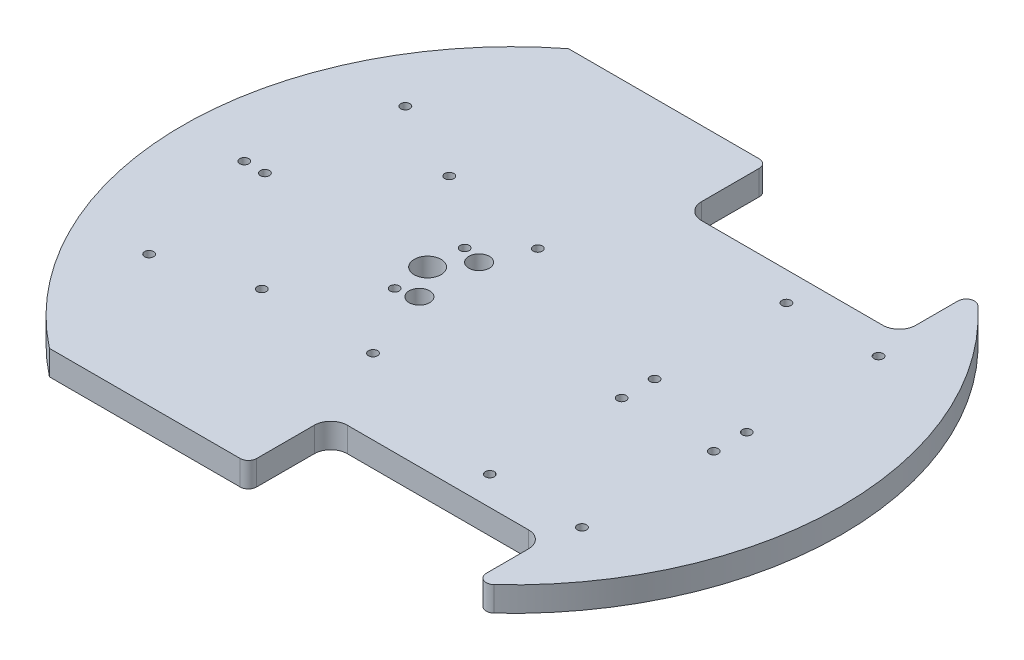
ISO-10303-21;
HEADER;
FILE_DESCRIPTION(('STEP AP214'),'2;1');
FILE_NAME('part.step','',(''),(''),'','','');
FILE_SCHEMA(('AUTOMOTIVE_DESIGN { 1 0 10303 214 1 1 1 1 }'));
ENDSEC;
DATA;
#1=APPLICATION_CONTEXT('core data for automotive mechanical design processes');
#2=APPLICATION_PROTOCOL_DEFINITION('international standard','automotive_design',2000,#1);
#3=PRODUCT_CONTEXT('',#1,'mechanical');
#4=PRODUCT('Part','Part','',(#3));
#5=PRODUCT_RELATED_PRODUCT_CATEGORY('part','',(#4));
#6=PRODUCT_DEFINITION_FORMATION('','',#4);
#7=PRODUCT_DEFINITION_CONTEXT('part definition',#1,'design');
#8=PRODUCT_DEFINITION('design','',#6,#7);
#9=PRODUCT_DEFINITION_SHAPE('','',#8);
#10=(LENGTH_UNIT() NAMED_UNIT(*) SI_UNIT(.MILLI.,.METRE.));
#11=(NAMED_UNIT(*) PLANE_ANGLE_UNIT() SI_UNIT($,.RADIAN.));
#12=(NAMED_UNIT(*) SI_UNIT($,.STERADIAN.) SOLID_ANGLE_UNIT());
#13=UNCERTAINTY_MEASURE_WITH_UNIT(LENGTH_MEASURE(1.E-05),#10,'distance_accuracy_value','');
#14=(GEOMETRIC_REPRESENTATION_CONTEXT(3) GLOBAL_UNCERTAINTY_ASSIGNED_CONTEXT((#13)) GLOBAL_UNIT_ASSIGNED_CONTEXT((#10,
#11,#12)) REPRESENTATION_CONTEXT('',''));
#15=CARTESIAN_POINT('',(0.,0.,0.));
#16=DIRECTION('',(0.,0.,1.));
#17=DIRECTION('',(1.,0.,0.));
#18=AXIS2_PLACEMENT_3D('',#15,#16,#17);
#19=CARTESIAN_POINT('',(-15.,6.,0.));
#20=DIRECTION('',(0.,1.,0.));
#21=DIRECTION('',(0.,0.,1.));
#22=AXIS2_PLACEMENT_3D('',#19,#20,#21);
#23=PLANE('',#22);
#24=CARTESIAN_POINT('',(-52.,6.,-21.75));
#25=DIRECTION('',(0.,1.,0.));
#26=DIRECTION('',(0.,0.,1.));
#27=AXIS2_PLACEMENT_3D('',#24,#25,#26);
#28=CIRCLE('',#27,1.1);
#29=CARTESIAN_POINT('',(-52.,6.,-20.65));
#30=VERTEX_POINT('',#29);
#31=EDGE_CURVE('E483',#30,#30,#28,.T.);
#32=ORIENTED_EDGE('',*,*,#31,.F.);
#33=EDGE_LOOP('',(#32));
#34=FACE_BOUND('',#33,.T.);
#35=CARTESIAN_POINT('',(-24.,6.,24.75));
#36=DIRECTION('',(0.,1.,0.));
#37=DIRECTION('',(0.,0.,-1.));
#38=AXIS2_PLACEMENT_3D('',#35,#36,#37);
#39=CIRCLE('',#38,1.1);
#40=CARTESIAN_POINT('',(-24.,6.,23.65));
#41=VERTEX_POINT('',#40);
#42=EDGE_CURVE('E495',#41,#41,#39,.T.);
#43=ORIENTED_EDGE('',*,*,#42,.F.);
#44=EDGE_LOOP('',(#43));
#45=FACE_BOUND('',#44,.T.);
#46=CARTESIAN_POINT('',(-30.25,6.,7.25));
#47=DIRECTION('',(0.,1.,0.));
#48=DIRECTION('',(0.,0.,1.));
#49=AXIS2_PLACEMENT_3D('',#46,#47,#48);
#50=CIRCLE('',#49,2.5);
#51=CARTESIAN_POINT('',(-30.25,6.,9.75));
#52=VERTEX_POINT('',#51);
#53=EDGE_CURVE('E507',#52,#52,#50,.T.);
#54=ORIENTED_EDGE('',*,*,#53,.F.);
#55=EDGE_LOOP('',(#54));
#56=FACE_BOUND('',#55,.T.);
#57=CARTESIAN_POINT('',(-35.,6.,-8.5));
#58=DIRECTION('',(0.,1.,0.));
#59=DIRECTION('',(0.,0.,1.));
#60=AXIS2_PLACEMENT_3D('',#57,#58,#59);
#61=CIRCLE('',#60,1.1);
#62=CARTESIAN_POINT('',(-35.,6.,-7.4));
#63=VERTEX_POINT('',#62);
#64=EDGE_CURVE('E519',#63,#63,#61,.T.);
#65=ORIENTED_EDGE('',*,*,#64,.F.);
#66=EDGE_LOOP('',(#65));
#67=FACE_BOUND('',#66,.T.);
#68=CARTESIAN_POINT('',(-80.,6.,0.));
#69=DIRECTION('',(0.,1.,0.));
#70=DIRECTION('',(0.,0.,1.));
#71=AXIS2_PLACEMENT_3D('',#68,#69,#70);
#72=CIRCLE('',#71,1.10000000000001);
#73=CARTESIAN_POINT('',(-80.,6.,1.10000000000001));
#74=VERTEX_POINT('',#73);
#75=EDGE_CURVE('E531',#74,#74,#72,.T.);
#76=ORIENTED_EDGE('',*,*,#75,.F.);
#77=EDGE_LOOP('',(#76));
#78=FACE_BOUND('',#77,.T.);
#79=CARTESIAN_POINT('',(-30.25,6.,-7.25));
#80=DIRECTION('',(0.,1.,0.));
#81=DIRECTION('',(0.,0.,-1.));
#82=AXIS2_PLACEMENT_3D('',#79,#80,#81);
#83=CIRCLE('',#82,2.5);
#84=CARTESIAN_POINT('',(-30.25,6.,-9.75));
#85=VERTEX_POINT('',#84);
#86=EDGE_CURVE('E543',#85,#85,#83,.T.);
#87=ORIENTED_EDGE('',*,*,#86,.F.);
#88=EDGE_LOOP('',(#87));
#89=FACE_BOUND('',#88,.T.);
#90=CARTESIAN_POINT('',(15.6,6.,-4.));
#91=DIRECTION('',(0.,1.,0.));
#92=DIRECTION('',(0.,0.,-1.));
#93=AXIS2_PLACEMENT_3D('',#90,#91,#92);
#94=CIRCLE('',#93,1.1);
#95=CARTESIAN_POINT('',(15.6,6.,-5.1));
#96=VERTEX_POINT('',#95);
#97=EDGE_CURVE('E555',#96,#96,#94,.T.);
#98=ORIENTED_EDGE('',*,*,#97,.F.);
#99=EDGE_LOOP('',(#98));
#100=FACE_BOUND('',#99,.T.);
#101=CARTESIAN_POINT('',(37.9590359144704,6.,-36.));
#102=DIRECTION('',(0.,1.,0.));
#103=DIRECTION('',(0.,0.,1.));
#104=AXIS2_PLACEMENT_3D('',#101,#102,#103);
#105=CIRCLE('',#104,1.1);
#106=CARTESIAN_POINT('',(37.9590359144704,6.,-34.9));
#107=VERTEX_POINT('',#106);
#108=EDGE_CURVE('E567',#107,#107,#105,.T.);
#109=ORIENTED_EDGE('',*,*,#108,.F.);
#110=EDGE_LOOP('',(#109));
#111=FACE_BOUND('',#110,.T.);
#112=CARTESIAN_POINT('',(37.9590359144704,6.,36.));
#113=DIRECTION('',(0.,1.,0.));
#114=DIRECTION('',(0.,0.,-1.));
#115=AXIS2_PLACEMENT_3D('',#112,#113,#114);
#116=CIRCLE('',#115,1.1);
#117=CARTESIAN_POINT('',(37.9590359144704,6.,34.9));
#118=VERTEX_POINT('',#117);
#119=EDGE_CURVE('E579',#118,#118,#116,.T.);
#120=ORIENTED_EDGE('',*,*,#119,.F.);
#121=EDGE_LOOP('',(#120));
#122=FACE_BOUND('',#121,.T.);
#123=CARTESIAN_POINT('',(15.6,6.,4.));
#124=DIRECTION('',(0.,1.,0.));
#125=DIRECTION('',(0.,0.,1.));
#126=AXIS2_PLACEMENT_3D('',#123,#124,#125);
#127=CIRCLE('',#126,1.1);
#128=CARTESIAN_POINT('',(15.6,6.,5.1));
#129=VERTEX_POINT('',#128);
#130=EDGE_CURVE('E591',#129,#129,#127,.T.);
#131=ORIENTED_EDGE('',*,*,#130,.F.);
#132=EDGE_LOOP('',(#131));
#133=FACE_BOUND('',#132,.T.);
#134=CARTESIAN_POINT('',(-15.,6.,0.));
#135=DIRECTION('',(0.,1.,0.));
#136=DIRECTION('',(0.,0.,1.));
#137=AXIS2_PLACEMENT_3D('',#134,#135,#136);
#138=CIRCLE('',#137,80.);
#139=CARTESIAN_POINT('',(-64.3051721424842,6.,-63.));
#140=VERTEX_POINT('',#139);
#141=CARTESIAN_POINT('',(-64.3051721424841,6.,63.));
#142=VERTEX_POINT('',#141);
#143=EDGE_CURVE('E215',#140,#142,#138,.T.);
#144=ORIENTED_EDGE('',*,*,#143,.T.);
#145=DIRECTION('',(1.,0.,0.));
#146=VECTOR('',#145,1.);
#147=CARTESIAN_POINT('',(-64.3051721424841,6.,63.));
#148=LINE('',#147,#146);
#149=CARTESIAN_POINT('',(-18.,6.,63.));
#150=VERTEX_POINT('',#149);
#151=EDGE_CURVE('E172',#142,#150,#148,.T.);
#152=ORIENTED_EDGE('',*,*,#151,.T.);
#153=CARTESIAN_POINT('',(-18.,6.,61.));
#154=DIRECTION('',(0.,1.,0.));
#155=DIRECTION('',(0.,0.,1.));
#156=AXIS2_PLACEMENT_3D('',#153,#154,#155);
#157=CIRCLE('',#156,2.);
#158=CARTESIAN_POINT('',(-16.,6.,61.));
#159=VERTEX_POINT('',#158);
#160=EDGE_CURVE('E218',#150,#159,#157,.T.);
#161=ORIENTED_EDGE('',*,*,#160,.T.);
#162=DIRECTION('',(0.,0.,-1.));
#163=VECTOR('',#162,1.);
#164=CARTESIAN_POINT('',(-16.,6.,61.));
#165=LINE('',#164,#163);
#166=CARTESIAN_POINT('',(-16.,6.,47.));
#167=VERTEX_POINT('',#166);
#168=EDGE_CURVE('E220',#159,#167,#165,.T.);
#169=ORIENTED_EDGE('',*,*,#168,.T.);
#170=CARTESIAN_POINT('',(-12.,6.,47.));
#171=DIRECTION('',(0.,-1.,0.));
#172=DIRECTION('',(0.,0.,-1.));
#173=AXIS2_PLACEMENT_3D('',#170,#171,#172);
#174=CIRCLE('',#173,4.);
#175=CARTESIAN_POINT('',(-12.,6.,43.));
#176=VERTEX_POINT('',#175);
#177=EDGE_CURVE('E222',#167,#176,#174,.T.);
#178=ORIENTED_EDGE('',*,*,#177,.T.);
#179=DIRECTION('',(1.,0.,0.));
#180=VECTOR('',#179,1.);
#181=CARTESIAN_POINT('',(-12.,6.,43.));
#182=LINE('',#181,#180);
#183=CARTESIAN_POINT('',(32.,6.,43.));
#184=VERTEX_POINT('',#183);
#185=EDGE_CURVE('E224',#176,#184,#182,.T.);
#186=ORIENTED_EDGE('',*,*,#185,.T.);
#187=CARTESIAN_POINT('',(32.,6.,47.));
#188=DIRECTION('',(0.,-1.,0.));
#189=DIRECTION('',(0.,0.,-1.));
#190=AXIS2_PLACEMENT_3D('',#187,#188,#189);
#191=CIRCLE('',#190,4.);
#192=CARTESIAN_POINT('',(36.,6.,47.));
#193=VERTEX_POINT('',#192);
#194=EDGE_CURVE('E226',#184,#193,#191,.T.);
#195=ORIENTED_EDGE('',*,*,#194,.T.);
#196=DIRECTION('',(0.,0.,1.));
#197=VECTOR('',#196,1.);
#198=CARTESIAN_POINT('',(36.,6.,57.227615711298));
#199=LINE('',#198,#197);
#200=CARTESIAN_POINT('',(36.,6.,57.227615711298));
#201=VERTEX_POINT('',#200);
#202=EDGE_CURVE('E228',#193,#201,#199,.T.);
#203=ORIENTED_EDGE('',*,*,#202,.T.);
#204=CARTESIAN_POINT('',(38.,6.,57.227615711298));
#205=DIRECTION('',(0.,1.,0.));
#206=DIRECTION('',(0.,0.,1.));
#207=AXIS2_PLACEMENT_3D('',#204,#205,#206);
#208=CIRCLE('',#207,2.);
#209=CARTESIAN_POINT('',(39.3589743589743,6.,58.6949904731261));
#210=VERTEX_POINT('',#209);
#211=EDGE_CURVE('E230',#201,#210,#208,.T.);
#212=ORIENTED_EDGE('',*,*,#211,.T.);
#213=CARTESIAN_POINT('',(-15.,6.,0.));
#214=DIRECTION('',(0.,1.,0.));
#215=DIRECTION('',(0.,0.,1.));
#216=AXIS2_PLACEMENT_3D('',#213,#214,#215);
#217=CIRCLE('',#216,80.);
#218=CARTESIAN_POINT('',(39.3589743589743,6.,-58.6949904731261));
#219=VERTEX_POINT('',#218);
#220=EDGE_CURVE('E232',#210,#219,#217,.T.);
#221=ORIENTED_EDGE('',*,*,#220,.T.);
#222=CARTESIAN_POINT('',(38.,6.,-57.227615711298));
#223=DIRECTION('',(0.,1.,0.));
#224=DIRECTION('',(0.,0.,1.));
#225=AXIS2_PLACEMENT_3D('',#222,#223,#224);
#226=CIRCLE('',#225,2.);
#227=CARTESIAN_POINT('',(36.,6.,-57.227615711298));
#228=VERTEX_POINT('',#227);
#229=EDGE_CURVE('E234',#219,#228,#226,.T.);
#230=ORIENTED_EDGE('',*,*,#229,.T.);
#231=DIRECTION('',(0.,0.,1.));
#232=VECTOR('',#231,1.);
#233=CARTESIAN_POINT('',(36.,6.,-57.227615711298));
#234=LINE('',#233,#232);
#235=CARTESIAN_POINT('',(36.,6.,-47.));
#236=VERTEX_POINT('',#235);
#237=EDGE_CURVE('E236',#228,#236,#234,.T.);
#238=ORIENTED_EDGE('',*,*,#237,.T.);
#239=CARTESIAN_POINT('',(32.,6.,-47.));
#240=DIRECTION('',(0.,-1.,0.));
#241=DIRECTION('',(0.,0.,-1.));
#242=AXIS2_PLACEMENT_3D('',#239,#240,#241);
#243=CIRCLE('',#242,4.);
#244=CARTESIAN_POINT('',(32.,6.,-43.));
#245=VERTEX_POINT('',#244);
#246=EDGE_CURVE('E238',#236,#245,#243,.T.);
#247=ORIENTED_EDGE('',*,*,#246,.T.);
#248=DIRECTION('',(-1.,0.,0.));
#249=VECTOR('',#248,1.);
#250=CARTESIAN_POINT('',(-12.,6.,-43.));
#251=LINE('',#250,#249);
#252=CARTESIAN_POINT('',(-12.,6.,-43.));
#253=VERTEX_POINT('',#252);
#254=EDGE_CURVE('E240',#245,#253,#251,.T.);
#255=ORIENTED_EDGE('',*,*,#254,.T.);
#256=CARTESIAN_POINT('',(-12.,6.,-47.));
#257=DIRECTION('',(0.,-1.,0.));
#258=DIRECTION('',(0.,0.,-1.));
#259=AXIS2_PLACEMENT_3D('',#256,#257,#258);
#260=CIRCLE('',#259,4.);
#261=CARTESIAN_POINT('',(-16.,6.,-47.));
#262=VERTEX_POINT('',#261);
#263=EDGE_CURVE('E242',#253,#262,#260,.T.);
#264=ORIENTED_EDGE('',*,*,#263,.T.);
#265=DIRECTION('',(0.,0.,-1.));
#266=VECTOR('',#265,1.);
#267=CARTESIAN_POINT('',(-16.,6.,-61.));
#268=LINE('',#267,#266);
#269=CARTESIAN_POINT('',(-16.,6.,-61.));
#270=VERTEX_POINT('',#269);
#271=EDGE_CURVE('E244',#262,#270,#268,.T.);
#272=ORIENTED_EDGE('',*,*,#271,.T.);
#273=CARTESIAN_POINT('',(-18.,6.,-61.));
#274=DIRECTION('',(0.,1.,0.));
#275=DIRECTION('',(0.,0.,1.));
#276=AXIS2_PLACEMENT_3D('',#273,#274,#275);
#277=CIRCLE('',#276,2.);
#278=CARTESIAN_POINT('',(-18.,6.,-63.));
#279=VERTEX_POINT('',#278);
#280=EDGE_CURVE('E53',#270,#279,#277,.T.);
#281=ORIENTED_EDGE('',*,*,#280,.T.);
#282=DIRECTION('',(-1.,0.,0.));
#283=VECTOR('',#282,1.);
#284=CARTESIAN_POINT('',(-64.3051721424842,6.,-63.));
#285=LINE('',#284,#283);
#286=EDGE_CURVE('E48',#279,#140,#285,.T.);
#287=ORIENTED_EDGE('',*,*,#286,.T.);
#288=EDGE_LOOP('',(#144,#152,#161,#169,#178,#186,#195,#203,#212,#221,#230,#238,#247,#255,#264,
#272,#281,#287));
#289=FACE_BOUND('',#288,.T.);
#290=CARTESIAN_POINT('',(37.9590359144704,6.,-4.));
#291=DIRECTION('',(0.,1.,0.));
#292=DIRECTION('',(0.,0.,-1.));
#293=AXIS2_PLACEMENT_3D('',#290,#291,#292);
#294=CIRCLE('',#293,1.1);
#295=CARTESIAN_POINT('',(37.9590359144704,6.,-5.1));
#296=VERTEX_POINT('',#295);
#297=EDGE_CURVE('E177',#296,#296,#294,.T.);
#298=ORIENTED_EDGE('',*,*,#297,.F.);
#299=EDGE_LOOP('',(#298));
#300=FACE_BOUND('',#299,.T.);
#301=CARTESIAN_POINT('',(37.9590359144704,6.,4.));
#302=DIRECTION('',(0.,1.,0.));
#303=DIRECTION('',(0.,0.,1.));
#304=AXIS2_PLACEMENT_3D('',#301,#302,#303);
#305=CIRCLE('',#304,1.1);
#306=CARTESIAN_POINT('',(37.9590359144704,6.,5.1));
#307=VERTEX_POINT('',#306);
#308=EDGE_CURVE('E585',#307,#307,#305,.T.);
#309=ORIENTED_EDGE('',*,*,#308,.F.);
#310=EDGE_LOOP('',(#309));
#311=FACE_BOUND('',#310,.T.);
#312=CARTESIAN_POINT('',(15.6,6.,36.));
#313=DIRECTION('',(0.,1.,0.));
#314=DIRECTION('',(0.,0.,-1.));
#315=AXIS2_PLACEMENT_3D('',#312,#313,#314);
#316=CIRCLE('',#315,1.09999999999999);
#317=CARTESIAN_POINT('',(15.6,6.,34.9));
#318=VERTEX_POINT('',#317);
#319=EDGE_CURVE('E573',#318,#318,#316,.T.);
#320=ORIENTED_EDGE('',*,*,#319,.F.);
#321=EDGE_LOOP('',(#320));
#322=FACE_BOUND('',#321,.T.);
#323=CARTESIAN_POINT('',(15.6,6.,-36.));
#324=DIRECTION('',(0.,1.,0.));
#325=DIRECTION('',(0.,0.,1.));
#326=AXIS2_PLACEMENT_3D('',#323,#324,#325);
#327=CIRCLE('',#326,1.09999999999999);
#328=CARTESIAN_POINT('',(15.6,6.,-34.9));
#329=VERTEX_POINT('',#328);
#330=EDGE_CURVE('E561',#329,#329,#327,.T.);
#331=ORIENTED_EDGE('',*,*,#330,.F.);
#332=EDGE_LOOP('',(#331));
#333=FACE_BOUND('',#332,.T.);
#334=CARTESIAN_POINT('',(-35.,6.,8.5));
#335=DIRECTION('',(0.,1.,0.));
#336=DIRECTION('',(0.,0.,-1.));
#337=AXIS2_PLACEMENT_3D('',#334,#335,#336);
#338=CIRCLE('',#337,1.1);
#339=CARTESIAN_POINT('',(-35.,6.,7.4));
#340=VERTEX_POINT('',#339);
#341=EDGE_CURVE('E549',#340,#340,#338,.T.);
#342=ORIENTED_EDGE('',*,*,#341,.F.);
#343=EDGE_LOOP('',(#342));
#344=FACE_BOUND('',#343,.T.);
#345=CARTESIAN_POINT('',(-72.,6.,31.1));
#346=DIRECTION('',(0.,1.,0.));
#347=DIRECTION('',(0.,0.,-1.));
#348=AXIS2_PLACEMENT_3D('',#345,#346,#347);
#349=CIRCLE('',#348,1.10000000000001);
#350=CARTESIAN_POINT('',(-72.,6.,30.));
#351=VERTEX_POINT('',#350);
#352=EDGE_CURVE('E537',#351,#351,#349,.T.);
#353=ORIENTED_EDGE('',*,*,#352,.F.);
#354=EDGE_LOOP('',(#353));
#355=FACE_BOUND('',#354,.T.);
#356=CARTESIAN_POINT('',(-72.,6.,-31.1));
#357=DIRECTION('',(0.,1.,0.));
#358=DIRECTION('',(0.,0.,1.));
#359=AXIS2_PLACEMENT_3D('',#356,#357,#358);
#360=CIRCLE('',#359,1.10000000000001);
#361=CARTESIAN_POINT('',(-72.,6.,-30.));
#362=VERTEX_POINT('',#361);
#363=EDGE_CURVE('E525',#362,#362,#360,.T.);
#364=ORIENTED_EDGE('',*,*,#363,.F.);
#365=EDGE_LOOP('',(#364));
#366=FACE_BOUND('',#365,.T.);
#367=CARTESIAN_POINT('',(-35.5,6.,0.));
#368=DIRECTION('',(0.,1.,0.));
#369=DIRECTION('',(0.,0.,1.));
#370=AXIS2_PLACEMENT_3D('',#367,#368,#369);
#371=CIRCLE('',#370,3.25);
#372=CARTESIAN_POINT('',(-35.5,6.,3.25));
#373=VERTEX_POINT('',#372);
#374=EDGE_CURVE('E513',#373,#373,#371,.T.);
#375=ORIENTED_EDGE('',*,*,#374,.F.);
#376=EDGE_LOOP('',(#375));
#377=FACE_BOUND('',#376,.T.);
#378=CARTESIAN_POINT('',(-51.,6.,24.75));
#379=DIRECTION('',(0.,1.,0.));
#380=DIRECTION('',(0.,0.,1.));
#381=AXIS2_PLACEMENT_3D('',#378,#379,#380);
#382=CIRCLE('',#381,1.1);
#383=CARTESIAN_POINT('',(-51.,6.,25.85));
#384=VERTEX_POINT('',#383);
#385=EDGE_CURVE('E501',#384,#384,#382,.T.);
#386=ORIENTED_EDGE('',*,*,#385,.F.);
#387=EDGE_LOOP('',(#386));
#388=FACE_BOUND('',#387,.T.);
#389=CARTESIAN_POINT('',(-26.,6.,-17.25));
#390=DIRECTION('',(0.,1.,0.));
#391=DIRECTION('',(0.,0.,1.));
#392=AXIS2_PLACEMENT_3D('',#389,#390,#391);
#393=CIRCLE('',#392,1.1);
#394=CARTESIAN_POINT('',(-26.,6.,-16.15));
#395=VERTEX_POINT('',#394);
#396=EDGE_CURVE('E489',#395,#395,#393,.T.);
#397=ORIENTED_EDGE('',*,*,#396,.F.);
#398=EDGE_LOOP('',(#397));
#399=FACE_BOUND('',#398,.T.);
#400=CARTESIAN_POINT('',(-75.,6.,0.));
#401=DIRECTION('',(0.,1.,0.));
#402=DIRECTION('',(0.,0.,1.));
#403=AXIS2_PLACEMENT_3D('',#400,#401,#402);
#404=CIRCLE('',#403,1.10000000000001);
#405=CARTESIAN_POINT('',(-75.,6.,1.10000000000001));
#406=VERTEX_POINT('',#405);
#407=EDGE_CURVE('E472',#406,#406,#404,.T.);
#408=ORIENTED_EDGE('',*,*,#407,.F.);
#409=EDGE_LOOP('',(#408));
#410=FACE_BOUND('',#409,.T.);
#411=ADVANCED_FACE('F33',(#34,#45,#56,#67,#78,#89,#100,#111,#122,#133,#289,#300,#311,#322,#333,
#344,#355,#366,#377,#388,#399,#410),#23,.T.);
#412=CARTESIAN_POINT('',(-15.,0.,0.));
#413=DIRECTION('',(0.,1.,0.));
#414=DIRECTION('',(0.,0.,1.));
#415=AXIS2_PLACEMENT_3D('',#412,#413,#414);
#416=PLANE('',#415);
#417=CARTESIAN_POINT('',(-52.,0.,-21.75));
#418=DIRECTION('',(0.,1.,0.));
#419=DIRECTION('',(0.,0.,1.));
#420=AXIS2_PLACEMENT_3D('',#417,#418,#419);
#421=CIRCLE('',#420,1.1);
#422=CARTESIAN_POINT('',(-52.,0.,-20.65));
#423=VERTEX_POINT('',#422);
#424=EDGE_CURVE('E478',#423,#423,#421,.T.);
#425=ORIENTED_EDGE('',*,*,#424,.T.);
#426=EDGE_LOOP('',(#425));
#427=FACE_BOUND('',#426,.T.);
#428=CARTESIAN_POINT('',(-24.,0.,24.75));
#429=DIRECTION('',(0.,1.,0.));
#430=DIRECTION('',(0.,0.,-1.));
#431=AXIS2_PLACEMENT_3D('',#428,#429,#430);
#432=CIRCLE('',#431,1.1);
#433=CARTESIAN_POINT('',(-24.,0.,23.65));
#434=VERTEX_POINT('',#433);
#435=EDGE_CURVE('E492',#434,#434,#432,.T.);
#436=ORIENTED_EDGE('',*,*,#435,.T.);
#437=EDGE_LOOP('',(#436));
#438=FACE_BOUND('',#437,.T.);
#439=CARTESIAN_POINT('',(-30.25,0.,7.25));
#440=DIRECTION('',(0.,1.,0.));
#441=DIRECTION('',(0.,0.,1.));
#442=AXIS2_PLACEMENT_3D('',#439,#440,#441);
#443=CIRCLE('',#442,2.5);
#444=CARTESIAN_POINT('',(-30.25,0.,9.75));
#445=VERTEX_POINT('',#444);
#446=EDGE_CURVE('E504',#445,#445,#443,.T.);
#447=ORIENTED_EDGE('',*,*,#446,.T.);
#448=EDGE_LOOP('',(#447));
#449=FACE_BOUND('',#448,.T.);
#450=CARTESIAN_POINT('',(-35.,0.,-8.5));
#451=DIRECTION('',(0.,1.,0.));
#452=DIRECTION('',(0.,0.,1.));
#453=AXIS2_PLACEMENT_3D('',#450,#451,#452);
#454=CIRCLE('',#453,1.1);
#455=CARTESIAN_POINT('',(-35.,0.,-7.4));
#456=VERTEX_POINT('',#455);
#457=EDGE_CURVE('E516',#456,#456,#454,.T.);
#458=ORIENTED_EDGE('',*,*,#457,.T.);
#459=EDGE_LOOP('',(#458));
#460=FACE_BOUND('',#459,.T.);
#461=CARTESIAN_POINT('',(-80.,0.,0.));
#462=DIRECTION('',(0.,1.,0.));
#463=DIRECTION('',(0.,0.,1.));
#464=AXIS2_PLACEMENT_3D('',#461,#462,#463);
#465=CIRCLE('',#464,1.10000000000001);
#466=CARTESIAN_POINT('',(-80.,0.,1.10000000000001));
#467=VERTEX_POINT('',#466);
#468=EDGE_CURVE('E528',#467,#467,#465,.T.);
#469=ORIENTED_EDGE('',*,*,#468,.T.);
#470=EDGE_LOOP('',(#469));
#471=FACE_BOUND('',#470,.T.);
#472=CARTESIAN_POINT('',(-30.25,0.,-7.25));
#473=DIRECTION('',(0.,1.,0.));
#474=DIRECTION('',(0.,0.,-1.));
#475=AXIS2_PLACEMENT_3D('',#472,#473,#474);
#476=CIRCLE('',#475,2.5);
#477=CARTESIAN_POINT('',(-30.25,0.,-9.75));
#478=VERTEX_POINT('',#477);
#479=EDGE_CURVE('E540',#478,#478,#476,.T.);
#480=ORIENTED_EDGE('',*,*,#479,.T.);
#481=EDGE_LOOP('',(#480));
#482=FACE_BOUND('',#481,.T.);
#483=CARTESIAN_POINT('',(15.6,0.,-4.));
#484=DIRECTION('',(0.,1.,0.));
#485=DIRECTION('',(0.,0.,-1.));
#486=AXIS2_PLACEMENT_3D('',#483,#484,#485);
#487=CIRCLE('',#486,1.1);
#488=CARTESIAN_POINT('',(15.6,0.,-5.1));
#489=VERTEX_POINT('',#488);
#490=EDGE_CURVE('E552',#489,#489,#487,.T.);
#491=ORIENTED_EDGE('',*,*,#490,.T.);
#492=EDGE_LOOP('',(#491));
#493=FACE_BOUND('',#492,.T.);
#494=CARTESIAN_POINT('',(37.9590359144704,0.,-36.));
#495=DIRECTION('',(0.,1.,0.));
#496=DIRECTION('',(0.,0.,1.));
#497=AXIS2_PLACEMENT_3D('',#494,#495,#496);
#498=CIRCLE('',#497,1.1);
#499=CARTESIAN_POINT('',(37.9590359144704,0.,-34.9));
#500=VERTEX_POINT('',#499);
#501=EDGE_CURVE('E564',#500,#500,#498,.T.);
#502=ORIENTED_EDGE('',*,*,#501,.T.);
#503=EDGE_LOOP('',(#502));
#504=FACE_BOUND('',#503,.T.);
#505=CARTESIAN_POINT('',(37.9590359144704,0.,36.));
#506=DIRECTION('',(0.,1.,0.));
#507=DIRECTION('',(0.,0.,-1.));
#508=AXIS2_PLACEMENT_3D('',#505,#506,#507);
#509=CIRCLE('',#508,1.1);
#510=CARTESIAN_POINT('',(37.9590359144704,0.,34.9));
#511=VERTEX_POINT('',#510);
#512=EDGE_CURVE('E576',#511,#511,#509,.T.);
#513=ORIENTED_EDGE('',*,*,#512,.T.);
#514=EDGE_LOOP('',(#513));
#515=FACE_BOUND('',#514,.T.);
#516=CARTESIAN_POINT('',(15.6,0.,4.));
#517=DIRECTION('',(0.,1.,0.));
#518=DIRECTION('',(0.,0.,1.));
#519=AXIS2_PLACEMENT_3D('',#516,#517,#518);
#520=CIRCLE('',#519,1.1);
#521=CARTESIAN_POINT('',(15.6,0.,5.1));
#522=VERTEX_POINT('',#521);
#523=EDGE_CURVE('E588',#522,#522,#520,.T.);
#524=ORIENTED_EDGE('',*,*,#523,.T.);
#525=EDGE_LOOP('',(#524));
#526=FACE_BOUND('',#525,.T.);
#527=CARTESIAN_POINT('',(-15.,0.,0.));
#528=DIRECTION('',(0.,1.,0.));
#529=DIRECTION('',(0.,0.,1.));
#530=AXIS2_PLACEMENT_3D('',#527,#528,#529);
#531=CIRCLE('',#530,80.);
#532=CARTESIAN_POINT('',(-64.3051721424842,0.,-63.));
#533=VERTEX_POINT('',#532);
#534=CARTESIAN_POINT('',(-64.3051721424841,0.,63.));
#535=VERTEX_POINT('',#534);
#536=EDGE_CURVE('E163',#533,#535,#531,.T.);
#537=ORIENTED_EDGE('',*,*,#536,.F.);
#538=DIRECTION('',(-1.,0.,0.));
#539=VECTOR('',#538,1.);
#540=CARTESIAN_POINT('',(-64.3051721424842,0.,-63.));
#541=LINE('',#540,#539);
#542=CARTESIAN_POINT('',(-18.,0.,-63.));
#543=VERTEX_POINT('',#542);
#544=EDGE_CURVE('E213',#543,#533,#541,.T.);
#545=ORIENTED_EDGE('',*,*,#544,.F.);
#546=CARTESIAN_POINT('',(-18.,0.,-61.));
#547=DIRECTION('',(0.,1.,0.));
#548=DIRECTION('',(0.,0.,1.));
#549=AXIS2_PLACEMENT_3D('',#546,#547,#548);
#550=CIRCLE('',#549,2.);
#551=CARTESIAN_POINT('',(-16.,0.,-61.));
#552=VERTEX_POINT('',#551);
#553=EDGE_CURVE('E211',#552,#543,#550,.T.);
#554=ORIENTED_EDGE('',*,*,#553,.F.);
#555=DIRECTION('',(0.,0.,-1.));
#556=VECTOR('',#555,1.);
#557=CARTESIAN_POINT('',(-16.,0.,-61.));
#558=LINE('',#557,#556);
#559=CARTESIAN_POINT('',(-16.,0.,-47.));
#560=VERTEX_POINT('',#559);
#561=EDGE_CURVE('E209',#560,#552,#558,.T.);
#562=ORIENTED_EDGE('',*,*,#561,.F.);
#563=CARTESIAN_POINT('',(-12.,0.,-47.));
#564=DIRECTION('',(0.,-1.,0.));
#565=DIRECTION('',(0.,0.,-1.));
#566=AXIS2_PLACEMENT_3D('',#563,#564,#565);
#567=CIRCLE('',#566,4.);
#568=CARTESIAN_POINT('',(-12.,0.,-43.));
#569=VERTEX_POINT('',#568);
#570=EDGE_CURVE('E207',#569,#560,#567,.T.);
#571=ORIENTED_EDGE('',*,*,#570,.F.);
#572=DIRECTION('',(-1.,0.,0.));
#573=VECTOR('',#572,1.);
#574=CARTESIAN_POINT('',(-12.,0.,-43.));
#575=LINE('',#574,#573);
#576=CARTESIAN_POINT('',(32.,0.,-43.));
#577=VERTEX_POINT('',#576);
#578=EDGE_CURVE('E205',#577,#569,#575,.T.);
#579=ORIENTED_EDGE('',*,*,#578,.F.);
#580=CARTESIAN_POINT('',(32.,0.,-47.));
#581=DIRECTION('',(0.,-1.,0.));
#582=DIRECTION('',(0.,0.,-1.));
#583=AXIS2_PLACEMENT_3D('',#580,#581,#582);
#584=CIRCLE('',#583,4.);
#585=CARTESIAN_POINT('',(36.,0.,-47.));
#586=VERTEX_POINT('',#585);
#587=EDGE_CURVE('E203',#586,#577,#584,.T.);
#588=ORIENTED_EDGE('',*,*,#587,.F.);
#589=DIRECTION('',(0.,0.,1.));
#590=VECTOR('',#589,1.);
#591=CARTESIAN_POINT('',(36.,0.,-57.227615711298));
#592=LINE('',#591,#590);
#593=CARTESIAN_POINT('',(36.,0.,-57.227615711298));
#594=VERTEX_POINT('',#593);
#595=EDGE_CURVE('E201',#594,#586,#592,.T.);
#596=ORIENTED_EDGE('',*,*,#595,.F.);
#597=CARTESIAN_POINT('',(38.,0.,-57.227615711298));
#598=DIRECTION('',(0.,1.,0.));
#599=DIRECTION('',(0.,0.,1.));
#600=AXIS2_PLACEMENT_3D('',#597,#598,#599);
#601=CIRCLE('',#600,2.);
#602=CARTESIAN_POINT('',(39.3589743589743,0.,-58.6949904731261));
#603=VERTEX_POINT('',#602);
#604=EDGE_CURVE('E199',#603,#594,#601,.T.);
#605=ORIENTED_EDGE('',*,*,#604,.F.);
#606=CARTESIAN_POINT('',(-15.,0.,0.));
#607=DIRECTION('',(0.,1.,0.));
#608=DIRECTION('',(0.,0.,1.));
#609=AXIS2_PLACEMENT_3D('',#606,#607,#608);
#610=CIRCLE('',#609,80.);
#611=CARTESIAN_POINT('',(39.3589743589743,0.,58.6949904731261));
#612=VERTEX_POINT('',#611);
#613=EDGE_CURVE('E197',#612,#603,#610,.T.);
#614=ORIENTED_EDGE('',*,*,#613,.F.);
#615=CARTESIAN_POINT('',(38.,0.,57.227615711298));
#616=DIRECTION('',(0.,1.,0.));
#617=DIRECTION('',(0.,0.,1.));
#618=AXIS2_PLACEMENT_3D('',#615,#616,#617);
#619=CIRCLE('',#618,2.);
#620=CARTESIAN_POINT('',(36.,0.,57.227615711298));
#621=VERTEX_POINT('',#620);
#622=EDGE_CURVE('E195',#621,#612,#619,.T.);
#623=ORIENTED_EDGE('',*,*,#622,.F.);
#624=DIRECTION('',(0.,0.,1.));
#625=VECTOR('',#624,1.);
#626=CARTESIAN_POINT('',(36.,0.,57.227615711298));
#627=LINE('',#626,#625);
#628=CARTESIAN_POINT('',(36.,0.,47.));
#629=VERTEX_POINT('',#628);
#630=EDGE_CURVE('E193',#629,#621,#627,.T.);
#631=ORIENTED_EDGE('',*,*,#630,.F.);
#632=CARTESIAN_POINT('',(32.,0.,47.));
#633=DIRECTION('',(0.,-1.,0.));
#634=DIRECTION('',(0.,0.,-1.));
#635=AXIS2_PLACEMENT_3D('',#632,#633,#634);
#636=CIRCLE('',#635,4.);
#637=CARTESIAN_POINT('',(32.,0.,43.));
#638=VERTEX_POINT('',#637);
#639=EDGE_CURVE('E191',#638,#629,#636,.T.);
#640=ORIENTED_EDGE('',*,*,#639,.F.);
#641=DIRECTION('',(1.,0.,0.));
#642=VECTOR('',#641,1.);
#643=CARTESIAN_POINT('',(-12.,0.,43.));
#644=LINE('',#643,#642);
#645=CARTESIAN_POINT('',(-12.,0.,43.));
#646=VERTEX_POINT('',#645);
#647=EDGE_CURVE('E189',#646,#638,#644,.T.);
#648=ORIENTED_EDGE('',*,*,#647,.F.);
#649=CARTESIAN_POINT('',(-12.,0.,47.));
#650=DIRECTION('',(0.,-1.,0.));
#651=DIRECTION('',(0.,0.,-1.));
#652=AXIS2_PLACEMENT_3D('',#649,#650,#651);
#653=CIRCLE('',#652,4.);
#654=CARTESIAN_POINT('',(-16.,0.,47.));
#655=VERTEX_POINT('',#654);
#656=EDGE_CURVE('E187',#655,#646,#653,.T.);
#657=ORIENTED_EDGE('',*,*,#656,.F.);
#658=DIRECTION('',(0.,0.,-1.));
#659=VECTOR('',#658,1.);
#660=CARTESIAN_POINT('',(-16.,0.,61.));
#661=LINE('',#660,#659);
#662=CARTESIAN_POINT('',(-16.,0.,61.));
#663=VERTEX_POINT('',#662);
#664=EDGE_CURVE('E185',#663,#655,#661,.T.);
#665=ORIENTED_EDGE('',*,*,#664,.F.);
#666=CARTESIAN_POINT('',(-18.,0.,61.));
#667=DIRECTION('',(0.,1.,0.));
#668=DIRECTION('',(0.,0.,1.));
#669=AXIS2_PLACEMENT_3D('',#666,#667,#668);
#670=CIRCLE('',#669,2.);
#671=CARTESIAN_POINT('',(-18.,0.,63.));
#672=VERTEX_POINT('',#671);
#673=EDGE_CURVE('E165',#672,#663,#670,.T.);
#674=ORIENTED_EDGE('',*,*,#673,.F.);
#675=DIRECTION('',(1.,0.,0.));
#676=VECTOR('',#675,1.);
#677=CARTESIAN_POINT('',(-64.3051721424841,0.,63.));
#678=LINE('',#677,#676);
#679=EDGE_CURVE('E158',#535,#672,#678,.T.);
#680=ORIENTED_EDGE('',*,*,#679,.F.);
#681=EDGE_LOOP('',(#537,#545,#554,#562,#571,#579,#588,#596,#605,#614,#623,#631,#640,#648,#657,
#665,#674,#680));
#682=FACE_BOUND('',#681,.T.);
#683=CARTESIAN_POINT('',(37.9590359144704,0.,-4.));
#684=DIRECTION('',(0.,1.,0.));
#685=DIRECTION('',(0.,0.,-1.));
#686=AXIS2_PLACEMENT_3D('',#683,#684,#685);
#687=CIRCLE('',#686,1.1);
#688=CARTESIAN_POINT('',(37.9590359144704,0.,-5.1));
#689=VERTEX_POINT('',#688);
#690=EDGE_CURVE('E180',#689,#689,#687,.T.);
#691=ORIENTED_EDGE('',*,*,#690,.T.);
#692=EDGE_LOOP('',(#691));
#693=FACE_BOUND('',#692,.T.);
#694=CARTESIAN_POINT('',(37.9590359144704,0.,4.));
#695=DIRECTION('',(0.,1.,0.));
#696=DIRECTION('',(0.,0.,1.));
#697=AXIS2_PLACEMENT_3D('',#694,#695,#696);
#698=CIRCLE('',#697,1.1);
#699=CARTESIAN_POINT('',(37.9590359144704,0.,5.1));
#700=VERTEX_POINT('',#699);
#701=EDGE_CURVE('E582',#700,#700,#698,.T.);
#702=ORIENTED_EDGE('',*,*,#701,.T.);
#703=EDGE_LOOP('',(#702));
#704=FACE_BOUND('',#703,.T.);
#705=CARTESIAN_POINT('',(15.6,0.,36.));
#706=DIRECTION('',(0.,1.,0.));
#707=DIRECTION('',(0.,0.,-1.));
#708=AXIS2_PLACEMENT_3D('',#705,#706,#707);
#709=CIRCLE('',#708,1.09999999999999);
#710=CARTESIAN_POINT('',(15.6,0.,34.9));
#711=VERTEX_POINT('',#710);
#712=EDGE_CURVE('E570',#711,#711,#709,.T.);
#713=ORIENTED_EDGE('',*,*,#712,.T.);
#714=EDGE_LOOP('',(#713));
#715=FACE_BOUND('',#714,.T.);
#716=CARTESIAN_POINT('',(15.6,0.,-36.));
#717=DIRECTION('',(0.,1.,0.));
#718=DIRECTION('',(0.,0.,1.));
#719=AXIS2_PLACEMENT_3D('',#716,#717,#718);
#720=CIRCLE('',#719,1.09999999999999);
#721=CARTESIAN_POINT('',(15.6,0.,-34.9));
#722=VERTEX_POINT('',#721);
#723=EDGE_CURVE('E558',#722,#722,#720,.T.);
#724=ORIENTED_EDGE('',*,*,#723,.T.);
#725=EDGE_LOOP('',(#724));
#726=FACE_BOUND('',#725,.T.);
#727=CARTESIAN_POINT('',(-35.,0.,8.5));
#728=DIRECTION('',(0.,1.,0.));
#729=DIRECTION('',(0.,0.,-1.));
#730=AXIS2_PLACEMENT_3D('',#727,#728,#729);
#731=CIRCLE('',#730,1.1);
#732=CARTESIAN_POINT('',(-35.,0.,7.4));
#733=VERTEX_POINT('',#732);
#734=EDGE_CURVE('E546',#733,#733,#731,.T.);
#735=ORIENTED_EDGE('',*,*,#734,.T.);
#736=EDGE_LOOP('',(#735));
#737=FACE_BOUND('',#736,.T.);
#738=CARTESIAN_POINT('',(-72.,0.,31.1));
#739=DIRECTION('',(0.,1.,0.));
#740=DIRECTION('',(0.,0.,-1.));
#741=AXIS2_PLACEMENT_3D('',#738,#739,#740);
#742=CIRCLE('',#741,1.10000000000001);
#743=CARTESIAN_POINT('',(-72.,0.,30.));
#744=VERTEX_POINT('',#743);
#745=EDGE_CURVE('E534',#744,#744,#742,.T.);
#746=ORIENTED_EDGE('',*,*,#745,.T.);
#747=EDGE_LOOP('',(#746));
#748=FACE_BOUND('',#747,.T.);
#749=CARTESIAN_POINT('',(-72.,0.,-31.1));
#750=DIRECTION('',(0.,1.,0.));
#751=DIRECTION('',(0.,0.,1.));
#752=AXIS2_PLACEMENT_3D('',#749,#750,#751);
#753=CIRCLE('',#752,1.10000000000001);
#754=CARTESIAN_POINT('',(-72.,0.,-30.));
#755=VERTEX_POINT('',#754);
#756=EDGE_CURVE('E522',#755,#755,#753,.T.);
#757=ORIENTED_EDGE('',*,*,#756,.T.);
#758=EDGE_LOOP('',(#757));
#759=FACE_BOUND('',#758,.T.);
#760=CARTESIAN_POINT('',(-35.5,0.,0.));
#761=DIRECTION('',(0.,1.,0.));
#762=DIRECTION('',(0.,0.,1.));
#763=AXIS2_PLACEMENT_3D('',#760,#761,#762);
#764=CIRCLE('',#763,3.25);
#765=CARTESIAN_POINT('',(-35.5,0.,3.25));
#766=VERTEX_POINT('',#765);
#767=EDGE_CURVE('E510',#766,#766,#764,.T.);
#768=ORIENTED_EDGE('',*,*,#767,.T.);
#769=EDGE_LOOP('',(#768));
#770=FACE_BOUND('',#769,.T.);
#771=CARTESIAN_POINT('',(-51.,0.,24.75));
#772=DIRECTION('',(0.,1.,0.));
#773=DIRECTION('',(0.,0.,1.));
#774=AXIS2_PLACEMENT_3D('',#771,#772,#773);
#775=CIRCLE('',#774,1.1);
#776=CARTESIAN_POINT('',(-51.,0.,25.85));
#777=VERTEX_POINT('',#776);
#778=EDGE_CURVE('E498',#777,#777,#775,.T.);
#779=ORIENTED_EDGE('',*,*,#778,.T.);
#780=EDGE_LOOP('',(#779));
#781=FACE_BOUND('',#780,.T.);
#782=CARTESIAN_POINT('',(-26.,0.,-17.25));
#783=DIRECTION('',(0.,1.,0.));
#784=DIRECTION('',(0.,0.,1.));
#785=AXIS2_PLACEMENT_3D('',#782,#783,#784);
#786=CIRCLE('',#785,1.1);
#787=CARTESIAN_POINT('',(-26.,0.,-16.15));
#788=VERTEX_POINT('',#787);
#789=EDGE_CURVE('E486',#788,#788,#786,.T.);
#790=ORIENTED_EDGE('',*,*,#789,.T.);
#791=EDGE_LOOP('',(#790));
#792=FACE_BOUND('',#791,.T.);
#793=CARTESIAN_POINT('',(-75.,0.,0.));
#794=DIRECTION('',(0.,1.,0.));
#795=DIRECTION('',(0.,0.,1.));
#796=AXIS2_PLACEMENT_3D('',#793,#794,#795);
#797=CIRCLE('',#796,1.10000000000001);
#798=CARTESIAN_POINT('',(-75.,0.,1.10000000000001));
#799=VERTEX_POINT('',#798);
#800=EDGE_CURVE('E475',#799,#799,#797,.T.);
#801=ORIENTED_EDGE('',*,*,#800,.T.);
#802=EDGE_LOOP('',(#801));
#803=FACE_BOUND('',#802,.T.);
#804=ADVANCED_FACE('F159',(#427,#438,#449,#460,#471,#482,#493,#504,#515,#526,#682,#693,#704,
#715,#726,#737,#748,#759,#770,#781,#792,#803),#416,.F.);
#805=CARTESIAN_POINT('',(-15.,6.,0.));
#806=DIRECTION('',(0.,-1.,0.));
#807=DIRECTION('',(0.,0.,-1.));
#808=AXIS2_PLACEMENT_3D('',#805,#806,#807);
#809=CYLINDRICAL_SURFACE('',#808,80.);
#810=ORIENTED_EDGE('',*,*,#536,.T.);
#811=DIRECTION('',(0.,-1.,0.));
#812=VECTOR('',#811,1.);
#813=CARTESIAN_POINT('',(-64.3051721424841,6.,63.));
#814=LINE('',#813,#812);
#815=EDGE_CURVE('E11',#142,#535,#814,.T.);
#816=ORIENTED_EDGE('',*,*,#815,.F.);
#817=ORIENTED_EDGE('',*,*,#143,.F.);
#818=DIRECTION('',(0.,-1.,0.));
#819=VECTOR('',#818,1.);
#820=CARTESIAN_POINT('',(-64.3051721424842,6.,-63.));
#821=LINE('',#820,#819);
#822=EDGE_CURVE('E176',#140,#533,#821,.T.);
#823=ORIENTED_EDGE('',*,*,#822,.T.);
#824=EDGE_LOOP('',(#810,#816,#817,#823));
#825=FACE_BOUND('',#824,.T.);
#826=ADVANCED_FACE('F35',(#825),#809,.T.);
#827=CARTESIAN_POINT('',(-64.3051721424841,6.,63.));
#828=DIRECTION('',(0.,0.,-1.));
#829=DIRECTION('',(-1.,0.,0.));
#830=AXIS2_PLACEMENT_3D('',#827,#828,#829);
#831=PLANE('',#830);
#832=ORIENTED_EDGE('',*,*,#679,.T.);
#833=DIRECTION('',(0.,-1.,0.));
#834=VECTOR('',#833,1.);
#835=CARTESIAN_POINT('',(-18.,6.,63.));
#836=LINE('',#835,#834);
#837=EDGE_CURVE('E41',#150,#672,#836,.T.);
#838=ORIENTED_EDGE('',*,*,#837,.F.);
#839=ORIENTED_EDGE('',*,*,#151,.F.);
#840=ORIENTED_EDGE('',*,*,#815,.T.);
#841=EDGE_LOOP('',(#832,#838,#839,#840));
#842=FACE_BOUND('',#841,.T.);
#843=ADVANCED_FACE('F171',(#842),#831,.F.);
#844=CARTESIAN_POINT('',(-18.,6.,61.));
#845=DIRECTION('',(0.,-1.,0.));
#846=DIRECTION('',(0.,0.,-1.));
#847=AXIS2_PLACEMENT_3D('',#844,#845,#846);
#848=CYLINDRICAL_SURFACE('',#847,2.);
#849=ORIENTED_EDGE('',*,*,#673,.T.);
#850=DIRECTION('',(0.,-1.,0.));
#851=VECTOR('',#850,1.);
#852=CARTESIAN_POINT('',(-16.,6.,61.));
#853=LINE('',#852,#851);
#854=EDGE_CURVE('E291',#159,#663,#853,.T.);
#855=ORIENTED_EDGE('',*,*,#854,.F.);
#856=ORIENTED_EDGE('',*,*,#160,.F.);
#857=ORIENTED_EDGE('',*,*,#837,.T.);
#858=EDGE_LOOP('',(#849,#855,#856,#857));
#859=FACE_BOUND('',#858,.T.);
#860=ADVANCED_FACE('F295',(#859),#848,.T.);
#861=CARTESIAN_POINT('',(-16.,6.,61.));
#862=DIRECTION('',(-1.,0.,0.));
#863=DIRECTION('',(0.,0.,1.));
#864=AXIS2_PLACEMENT_3D('',#861,#862,#863);
#865=PLANE('',#864);
#866=ORIENTED_EDGE('',*,*,#664,.T.);
#867=DIRECTION('',(0.,-1.,0.));
#868=VECTOR('',#867,1.);
#869=CARTESIAN_POINT('',(-16.,6.,47.));
#870=LINE('',#869,#868);
#871=EDGE_CURVE('E288',#167,#655,#870,.T.);
#872=ORIENTED_EDGE('',*,*,#871,.F.);
#873=ORIENTED_EDGE('',*,*,#168,.F.);
#874=ORIENTED_EDGE('',*,*,#854,.T.);
#875=EDGE_LOOP('',(#866,#872,#873,#874));
#876=FACE_BOUND('',#875,.T.);
#877=ADVANCED_FACE('F303',(#876),#865,.F.);
#878=CARTESIAN_POINT('',(-12.,6.,47.));
#879=DIRECTION('',(0.,-1.,0.));
#880=DIRECTION('',(0.,0.,-1.));
#881=AXIS2_PLACEMENT_3D('',#878,#879,#880);
#882=CYLINDRICAL_SURFACE('',#881,4.);
#883=ORIENTED_EDGE('',*,*,#656,.T.);
#884=DIRECTION('',(0.,-1.,0.));
#885=VECTOR('',#884,1.);
#886=CARTESIAN_POINT('',(-12.,6.,43.));
#887=LINE('',#886,#885);
#888=EDGE_CURVE('E285',#176,#646,#887,.T.);
#889=ORIENTED_EDGE('',*,*,#888,.F.);
#890=ORIENTED_EDGE('',*,*,#177,.F.);
#891=ORIENTED_EDGE('',*,*,#871,.T.);
#892=EDGE_LOOP('',(#883,#889,#890,#891));
#893=FACE_BOUND('',#892,.T.);
#894=ADVANCED_FACE('F306',(#893),#882,.F.);
#895=CARTESIAN_POINT('',(-12.,6.,43.));
#896=DIRECTION('',(0.,0.,-1.));
#897=DIRECTION('',(-1.,0.,0.));
#898=AXIS2_PLACEMENT_3D('',#895,#896,#897);
#899=PLANE('',#898);
#900=ORIENTED_EDGE('',*,*,#647,.T.);
#901=DIRECTION('',(0.,-1.,0.));
#902=VECTOR('',#901,1.);
#903=CARTESIAN_POINT('',(32.,6.,43.));
#904=LINE('',#903,#902);
#905=EDGE_CURVE('E282',#184,#638,#904,.T.);
#906=ORIENTED_EDGE('',*,*,#905,.F.);
#907=ORIENTED_EDGE('',*,*,#185,.F.);
#908=ORIENTED_EDGE('',*,*,#888,.T.);
#909=EDGE_LOOP('',(#900,#906,#907,#908));
#910=FACE_BOUND('',#909,.T.);
#911=ADVANCED_FACE('F311',(#910),#899,.F.);
#912=CARTESIAN_POINT('',(32.,6.,47.));
#913=DIRECTION('',(0.,-1.,0.));
#914=DIRECTION('',(0.,0.,-1.));
#915=AXIS2_PLACEMENT_3D('',#912,#913,#914);
#916=CYLINDRICAL_SURFACE('',#915,4.);
#917=ORIENTED_EDGE('',*,*,#639,.T.);
#918=DIRECTION('',(0.,-1.,0.));
#919=VECTOR('',#918,1.);
#920=CARTESIAN_POINT('',(36.,6.,47.));
#921=LINE('',#920,#919);
#922=EDGE_CURVE('E279',#193,#629,#921,.T.);
#923=ORIENTED_EDGE('',*,*,#922,.F.);
#924=ORIENTED_EDGE('',*,*,#194,.F.);
#925=ORIENTED_EDGE('',*,*,#905,.T.);
#926=EDGE_LOOP('',(#917,#923,#924,#925));
#927=FACE_BOUND('',#926,.T.);
#928=ADVANCED_FACE('F317',(#927),#916,.F.);
#929=CARTESIAN_POINT('',(36.,6.,57.227615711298));
#930=DIRECTION('',(1.,0.,0.));
#931=DIRECTION('',(0.,0.,-1.));
#932=AXIS2_PLACEMENT_3D('',#929,#930,#931);
#933=PLANE('',#932);
#934=ORIENTED_EDGE('',*,*,#630,.T.);
#935=DIRECTION('',(0.,-1.,0.));
#936=VECTOR('',#935,1.);
#937=CARTESIAN_POINT('',(36.,6.,57.227615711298));
#938=LINE('',#937,#936);
#939=EDGE_CURVE('E276',#201,#621,#938,.T.);
#940=ORIENTED_EDGE('',*,*,#939,.F.);
#941=ORIENTED_EDGE('',*,*,#202,.F.);
#942=ORIENTED_EDGE('',*,*,#922,.T.);
#943=EDGE_LOOP('',(#934,#940,#941,#942));
#944=FACE_BOUND('',#943,.T.);
#945=ADVANCED_FACE('F321',(#944),#933,.F.);
#946=CARTESIAN_POINT('',(38.,6.,57.227615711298));
#947=DIRECTION('',(0.,-1.,0.));
#948=DIRECTION('',(0.,0.,-1.));
#949=AXIS2_PLACEMENT_3D('',#946,#947,#948);
#950=CYLINDRICAL_SURFACE('',#949,2.);
#951=ORIENTED_EDGE('',*,*,#622,.T.);
#952=DIRECTION('',(0.,-1.,0.));
#953=VECTOR('',#952,1.);
#954=CARTESIAN_POINT('',(39.3589743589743,6.,58.6949904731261));
#955=LINE('',#954,#953);
#956=EDGE_CURVE('E273',#210,#612,#955,.T.);
#957=ORIENTED_EDGE('',*,*,#956,.F.);
#958=ORIENTED_EDGE('',*,*,#211,.F.);
#959=ORIENTED_EDGE('',*,*,#939,.T.);
#960=EDGE_LOOP('',(#951,#957,#958,#959));
#961=FACE_BOUND('',#960,.T.);
#962=ADVANCED_FACE('F326',(#961),#950,.T.);
#963=CARTESIAN_POINT('',(-15.,6.,0.));
#964=DIRECTION('',(0.,-1.,0.));
#965=DIRECTION('',(0.,0.,-1.));
#966=AXIS2_PLACEMENT_3D('',#963,#964,#965);
#967=CYLINDRICAL_SURFACE('',#966,80.);
#968=ORIENTED_EDGE('',*,*,#613,.T.);
#969=DIRECTION('',(0.,-1.,0.));
#970=VECTOR('',#969,1.);
#971=CARTESIAN_POINT('',(39.3589743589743,6.,-58.6949904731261));
#972=LINE('',#971,#970);
#973=EDGE_CURVE('E270',#219,#603,#972,.T.);
#974=ORIENTED_EDGE('',*,*,#973,.F.);
#975=ORIENTED_EDGE('',*,*,#220,.F.);
#976=ORIENTED_EDGE('',*,*,#956,.T.);
#977=EDGE_LOOP('',(#968,#974,#975,#976));
#978=FACE_BOUND('',#977,.T.);
#979=ADVANCED_FACE('F332',(#978),#967,.T.);
#980=CARTESIAN_POINT('',(38.,6.,-57.227615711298));
#981=DIRECTION('',(0.,-1.,0.));
#982=DIRECTION('',(0.,0.,-1.));
#983=AXIS2_PLACEMENT_3D('',#980,#981,#982);
#984=CYLINDRICAL_SURFACE('',#983,2.);
#985=ORIENTED_EDGE('',*,*,#604,.T.);
#986=DIRECTION('',(0.,-1.,0.));
#987=VECTOR('',#986,1.);
#988=CARTESIAN_POINT('',(36.,6.,-57.227615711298));
#989=LINE('',#988,#987);
#990=EDGE_CURVE('E267',#228,#594,#989,.T.);
#991=ORIENTED_EDGE('',*,*,#990,.F.);
#992=ORIENTED_EDGE('',*,*,#229,.F.);
#993=ORIENTED_EDGE('',*,*,#973,.T.);
#994=EDGE_LOOP('',(#985,#991,#992,#993));
#995=FACE_BOUND('',#994,.T.);
#996=ADVANCED_FACE('F336',(#995),#984,.T.);
#997=CARTESIAN_POINT('',(36.,6.,-57.227615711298));
#998=DIRECTION('',(1.,0.,0.));
#999=DIRECTION('',(0.,0.,-1.));
#1000=AXIS2_PLACEMENT_3D('',#997,#998,#999);
#1001=PLANE('',#1000);
#1002=ORIENTED_EDGE('',*,*,#595,.T.);
#1003=DIRECTION('',(0.,-1.,0.));
#1004=VECTOR('',#1003,1.);
#1005=CARTESIAN_POINT('',(36.,6.,-47.));
#1006=LINE('',#1005,#1004);
#1007=EDGE_CURVE('E264',#236,#586,#1006,.T.);
#1008=ORIENTED_EDGE('',*,*,#1007,.F.);
#1009=ORIENTED_EDGE('',*,*,#237,.F.);
#1010=ORIENTED_EDGE('',*,*,#990,.T.);
#1011=EDGE_LOOP('',(#1002,#1008,#1009,#1010));
#1012=FACE_BOUND('',#1011,.T.);
#1013=ADVANCED_FACE('F341',(#1012),#1001,.F.);
#1014=CARTESIAN_POINT('',(32.,6.,-47.));
#1015=DIRECTION('',(0.,-1.,0.));
#1016=DIRECTION('',(0.,0.,-1.));
#1017=AXIS2_PLACEMENT_3D('',#1014,#1015,#1016);
#1018=CYLINDRICAL_SURFACE('',#1017,4.);
#1019=ORIENTED_EDGE('',*,*,#587,.T.);
#1020=DIRECTION('',(0.,-1.,0.));
#1021=VECTOR('',#1020,1.);
#1022=CARTESIAN_POINT('',(32.,6.,-43.));
#1023=LINE('',#1022,#1021);
#1024=EDGE_CURVE('E261',#245,#577,#1023,.T.);
#1025=ORIENTED_EDGE('',*,*,#1024,.F.);
#1026=ORIENTED_EDGE('',*,*,#246,.F.);
#1027=ORIENTED_EDGE('',*,*,#1007,.T.);
#1028=EDGE_LOOP('',(#1019,#1025,#1026,#1027));
#1029=FACE_BOUND('',#1028,.T.);
#1030=ADVANCED_FACE('F347',(#1029),#1018,.F.);
#1031=CARTESIAN_POINT('',(-12.,6.,-43.));
#1032=DIRECTION('',(0.,0.,1.));
#1033=DIRECTION('',(1.,0.,0.));
#1034=AXIS2_PLACEMENT_3D('',#1031,#1032,#1033);
#1035=PLANE('',#1034);
#1036=ORIENTED_EDGE('',*,*,#578,.T.);
#1037=DIRECTION('',(0.,-1.,0.));
#1038=VECTOR('',#1037,1.);
#1039=CARTESIAN_POINT('',(-12.,6.,-43.));
#1040=LINE('',#1039,#1038);
#1041=EDGE_CURVE('E258',#253,#569,#1040,.T.);
#1042=ORIENTED_EDGE('',*,*,#1041,.F.);
#1043=ORIENTED_EDGE('',*,*,#254,.F.);
#1044=ORIENTED_EDGE('',*,*,#1024,.T.);
#1045=EDGE_LOOP('',(#1036,#1042,#1043,#1044));
#1046=FACE_BOUND('',#1045,.T.);
#1047=ADVANCED_FACE('F351',(#1046),#1035,.F.);
#1048=CARTESIAN_POINT('',(-12.,6.,-47.));
#1049=DIRECTION('',(0.,-1.,0.));
#1050=DIRECTION('',(0.,0.,-1.));
#1051=AXIS2_PLACEMENT_3D('',#1048,#1049,#1050);
#1052=CYLINDRICAL_SURFACE('',#1051,4.);
#1053=ORIENTED_EDGE('',*,*,#570,.T.);
#1054=DIRECTION('',(0.,-1.,0.));
#1055=VECTOR('',#1054,1.);
#1056=CARTESIAN_POINT('',(-16.,6.,-47.));
#1057=LINE('',#1056,#1055);
#1058=EDGE_CURVE('E255',#262,#560,#1057,.T.);
#1059=ORIENTED_EDGE('',*,*,#1058,.F.);
#1060=ORIENTED_EDGE('',*,*,#263,.F.);
#1061=ORIENTED_EDGE('',*,*,#1041,.T.);
#1062=EDGE_LOOP('',(#1053,#1059,#1060,#1061));
#1063=FACE_BOUND('',#1062,.T.);
#1064=ADVANCED_FACE('F356',(#1063),#1052,.F.);
#1065=CARTESIAN_POINT('',(-16.,6.,-61.));
#1066=DIRECTION('',(-1.,0.,0.));
#1067=DIRECTION('',(0.,0.,1.));
#1068=AXIS2_PLACEMENT_3D('',#1065,#1066,#1067);
#1069=PLANE('',#1068);
#1070=ORIENTED_EDGE('',*,*,#561,.T.);
#1071=DIRECTION('',(0.,-1.,0.));
#1072=VECTOR('',#1071,1.);
#1073=CARTESIAN_POINT('',(-16.,6.,-61.));
#1074=LINE('',#1073,#1072);
#1075=EDGE_CURVE('E252',#270,#552,#1074,.T.);
#1076=ORIENTED_EDGE('',*,*,#1075,.F.);
#1077=ORIENTED_EDGE('',*,*,#271,.F.);
#1078=ORIENTED_EDGE('',*,*,#1058,.T.);
#1079=EDGE_LOOP('',(#1070,#1076,#1077,#1078));
#1080=FACE_BOUND('',#1079,.T.);
#1081=ADVANCED_FACE('F360',(#1080),#1069,.F.);
#1082=CARTESIAN_POINT('',(-18.,6.,-61.));
#1083=DIRECTION('',(0.,-1.,0.));
#1084=DIRECTION('',(0.,0.,-1.));
#1085=AXIS2_PLACEMENT_3D('',#1082,#1083,#1084);
#1086=CYLINDRICAL_SURFACE('',#1085,2.);
#1087=ORIENTED_EDGE('',*,*,#553,.T.);
#1088=DIRECTION('',(0.,-1.,0.));
#1089=VECTOR('',#1088,1.);
#1090=CARTESIAN_POINT('',(-18.,6.,-63.));
#1091=LINE('',#1090,#1089);
#1092=EDGE_CURVE('E249',#279,#543,#1091,.T.);
#1093=ORIENTED_EDGE('',*,*,#1092,.F.);
#1094=ORIENTED_EDGE('',*,*,#280,.F.);
#1095=ORIENTED_EDGE('',*,*,#1075,.T.);
#1096=EDGE_LOOP('',(#1087,#1093,#1094,#1095));
#1097=FACE_BOUND('',#1096,.T.);
#1098=ADVANCED_FACE('F364',(#1097),#1086,.T.);
#1099=CARTESIAN_POINT('',(-64.3051721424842,6.,-63.));
#1100=DIRECTION('',(0.,0.,1.));
#1101=DIRECTION('',(1.,0.,0.));
#1102=AXIS2_PLACEMENT_3D('',#1099,#1100,#1101);
#1103=PLANE('',#1102);
#1104=ORIENTED_EDGE('',*,*,#544,.T.);
#1105=ORIENTED_EDGE('',*,*,#822,.F.);
#1106=ORIENTED_EDGE('',*,*,#286,.F.);
#1107=ORIENTED_EDGE('',*,*,#1092,.T.);
#1108=EDGE_LOOP('',(#1104,#1105,#1106,#1107));
#1109=FACE_BOUND('',#1108,.T.);
#1110=ADVANCED_FACE('F366',(#1109),#1103,.F.);
#1111=CARTESIAN_POINT('',(37.9590359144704,6.,-4.));
#1112=DIRECTION('',(0.,-1.,0.));
#1113=DIRECTION('',(0.,0.,-1.));
#1114=AXIS2_PLACEMENT_3D('',#1111,#1112,#1113);
#1115=CYLINDRICAL_SURFACE('',#1114,1.1);
#1116=ORIENTED_EDGE('',*,*,#297,.T.);
#1117=EDGE_LOOP('',(#1116));
#1118=FACE_BOUND('',#1117,.T.);
#1119=ORIENTED_EDGE('',*,*,#690,.F.);
#1120=EDGE_LOOP('',(#1119));
#1121=FACE_BOUND('',#1120,.T.);
#1122=ADVANCED_FACE('F368',(#1118,#1121),#1115,.F.);
#1123=CARTESIAN_POINT('',(15.6,6.,4.));
#1124=DIRECTION('',(0.,-1.,0.));
#1125=DIRECTION('',(0.,0.,-1.));
#1126=AXIS2_PLACEMENT_3D('',#1123,#1124,#1125);
#1127=CYLINDRICAL_SURFACE('',#1126,1.1);
#1128=ORIENTED_EDGE('',*,*,#130,.T.);
#1129=EDGE_LOOP('',(#1128));
#1130=FACE_BOUND('',#1129,.T.);
#1131=ORIENTED_EDGE('',*,*,#523,.F.);
#1132=EDGE_LOOP('',(#1131));
#1133=FACE_BOUND('',#1132,.T.);
#1134=ADVANCED_FACE('F374',(#1130,#1133),#1127,.F.);
#1135=CARTESIAN_POINT('',(37.9590359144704,6.,4.));
#1136=DIRECTION('',(0.,-1.,0.));
#1137=DIRECTION('',(0.,0.,-1.));
#1138=AXIS2_PLACEMENT_3D('',#1135,#1136,#1137);
#1139=CYLINDRICAL_SURFACE('',#1138,1.1);
#1140=ORIENTED_EDGE('',*,*,#308,.T.);
#1141=EDGE_LOOP('',(#1140));
#1142=FACE_BOUND('',#1141,.T.);
#1143=ORIENTED_EDGE('',*,*,#701,.F.);
#1144=EDGE_LOOP('',(#1143));
#1145=FACE_BOUND('',#1144,.T.);
#1146=ADVANCED_FACE('F391',(#1142,#1145),#1139,.F.);
#1147=CARTESIAN_POINT('',(37.9590359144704,6.,36.));
#1148=DIRECTION('',(0.,-1.,0.));
#1149=DIRECTION('',(0.,0.,-1.));
#1150=AXIS2_PLACEMENT_3D('',#1147,#1148,#1149);
#1151=CYLINDRICAL_SURFACE('',#1150,1.1);
#1152=ORIENTED_EDGE('',*,*,#119,.T.);
#1153=EDGE_LOOP('',(#1152));
#1154=FACE_BOUND('',#1153,.T.);
#1155=ORIENTED_EDGE('',*,*,#512,.F.);
#1156=EDGE_LOOP('',(#1155));
#1157=FACE_BOUND('',#1156,.T.);
#1158=ADVANCED_FACE('F395',(#1154,#1157),#1151,.F.);
#1159=CARTESIAN_POINT('',(15.6,6.,36.));
#1160=DIRECTION('',(0.,-1.,0.));
#1161=DIRECTION('',(0.,0.,-1.));
#1162=AXIS2_PLACEMENT_3D('',#1159,#1160,#1161);
#1163=CYLINDRICAL_SURFACE('',#1162,1.09999999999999);
#1164=ORIENTED_EDGE('',*,*,#319,.T.);
#1165=EDGE_LOOP('',(#1164));
#1166=FACE_BOUND('',#1165,.T.);
#1167=ORIENTED_EDGE('',*,*,#712,.F.);
#1168=EDGE_LOOP('',(#1167));
#1169=FACE_BOUND('',#1168,.T.);
#1170=ADVANCED_FACE('F399',(#1166,#1169),#1163,.F.);
#1171=CARTESIAN_POINT('',(37.9590359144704,6.,-36.));
#1172=DIRECTION('',(0.,-1.,0.));
#1173=DIRECTION('',(0.,0.,-1.));
#1174=AXIS2_PLACEMENT_3D('',#1171,#1172,#1173);
#1175=CYLINDRICAL_SURFACE('',#1174,1.1);
#1176=ORIENTED_EDGE('',*,*,#108,.T.);
#1177=EDGE_LOOP('',(#1176));
#1178=FACE_BOUND('',#1177,.T.);
#1179=ORIENTED_EDGE('',*,*,#501,.F.);
#1180=EDGE_LOOP('',(#1179));
#1181=FACE_BOUND('',#1180,.T.);
#1182=ADVANCED_FACE('F403',(#1178,#1181),#1175,.F.);
#1183=CARTESIAN_POINT('',(15.6,6.,-36.));
#1184=DIRECTION('',(0.,-1.,0.));
#1185=DIRECTION('',(0.,0.,-1.));
#1186=AXIS2_PLACEMENT_3D('',#1183,#1184,#1185);
#1187=CYLINDRICAL_SURFACE('',#1186,1.09999999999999);
#1188=ORIENTED_EDGE('',*,*,#330,.T.);
#1189=EDGE_LOOP('',(#1188));
#1190=FACE_BOUND('',#1189,.T.);
#1191=ORIENTED_EDGE('',*,*,#723,.F.);
#1192=EDGE_LOOP('',(#1191));
#1193=FACE_BOUND('',#1192,.T.);
#1194=ADVANCED_FACE('F407',(#1190,#1193),#1187,.F.);
#1195=CARTESIAN_POINT('',(15.6,6.,-4.));
#1196=DIRECTION('',(0.,-1.,0.));
#1197=DIRECTION('',(0.,0.,-1.));
#1198=AXIS2_PLACEMENT_3D('',#1195,#1196,#1197);
#1199=CYLINDRICAL_SURFACE('',#1198,1.1);
#1200=ORIENTED_EDGE('',*,*,#97,.T.);
#1201=EDGE_LOOP('',(#1200));
#1202=FACE_BOUND('',#1201,.T.);
#1203=ORIENTED_EDGE('',*,*,#490,.F.);
#1204=EDGE_LOOP('',(#1203));
#1205=FACE_BOUND('',#1204,.T.);
#1206=ADVANCED_FACE('F411',(#1202,#1205),#1199,.F.);
#1207=CARTESIAN_POINT('',(-35.,6.,8.5));
#1208=DIRECTION('',(0.,-1.,0.));
#1209=DIRECTION('',(0.,0.,-1.));
#1210=AXIS2_PLACEMENT_3D('',#1207,#1208,#1209);
#1211=CYLINDRICAL_SURFACE('',#1210,1.1);
#1212=ORIENTED_EDGE('',*,*,#341,.T.);
#1213=EDGE_LOOP('',(#1212));
#1214=FACE_BOUND('',#1213,.T.);
#1215=ORIENTED_EDGE('',*,*,#734,.F.);
#1216=EDGE_LOOP('',(#1215));
#1217=FACE_BOUND('',#1216,.T.);
#1218=ADVANCED_FACE('F415',(#1214,#1217),#1211,.F.);
#1219=CARTESIAN_POINT('',(-30.25,6.,-7.25));
#1220=DIRECTION('',(0.,-1.,0.));
#1221=DIRECTION('',(0.,0.,-1.));
#1222=AXIS2_PLACEMENT_3D('',#1219,#1220,#1221);
#1223=CYLINDRICAL_SURFACE('',#1222,2.5);
#1224=ORIENTED_EDGE('',*,*,#86,.T.);
#1225=EDGE_LOOP('',(#1224));
#1226=FACE_BOUND('',#1225,.T.);
#1227=ORIENTED_EDGE('',*,*,#479,.F.);
#1228=EDGE_LOOP('',(#1227));
#1229=FACE_BOUND('',#1228,.T.);
#1230=ADVANCED_FACE('F419',(#1226,#1229),#1223,.F.);
#1231=CARTESIAN_POINT('',(-72.,6.,31.1));
#1232=DIRECTION('',(0.,-1.,0.));
#1233=DIRECTION('',(0.,0.,-1.));
#1234=AXIS2_PLACEMENT_3D('',#1231,#1232,#1233);
#1235=CYLINDRICAL_SURFACE('',#1234,1.10000000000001);
#1236=ORIENTED_EDGE('',*,*,#352,.T.);
#1237=EDGE_LOOP('',(#1236));
#1238=FACE_BOUND('',#1237,.T.);
#1239=ORIENTED_EDGE('',*,*,#745,.F.);
#1240=EDGE_LOOP('',(#1239));
#1241=FACE_BOUND('',#1240,.T.);
#1242=ADVANCED_FACE('F423',(#1238,#1241),#1235,.F.);
#1243=CARTESIAN_POINT('',(-80.,6.,0.));
#1244=DIRECTION('',(0.,-1.,0.));
#1245=DIRECTION('',(0.,0.,-1.));
#1246=AXIS2_PLACEMENT_3D('',#1243,#1244,#1245);
#1247=CYLINDRICAL_SURFACE('',#1246,1.10000000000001);
#1248=ORIENTED_EDGE('',*,*,#75,.T.);
#1249=EDGE_LOOP('',(#1248));
#1250=FACE_BOUND('',#1249,.T.);
#1251=ORIENTED_EDGE('',*,*,#468,.F.);
#1252=EDGE_LOOP('',(#1251));
#1253=FACE_BOUND('',#1252,.T.);
#1254=ADVANCED_FACE('F427',(#1250,#1253),#1247,.F.);
#1255=CARTESIAN_POINT('',(-72.,6.,-31.1));
#1256=DIRECTION('',(0.,-1.,0.));
#1257=DIRECTION('',(0.,0.,-1.));
#1258=AXIS2_PLACEMENT_3D('',#1255,#1256,#1257);
#1259=CYLINDRICAL_SURFACE('',#1258,1.10000000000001);
#1260=ORIENTED_EDGE('',*,*,#363,.T.);
#1261=EDGE_LOOP('',(#1260));
#1262=FACE_BOUND('',#1261,.T.);
#1263=ORIENTED_EDGE('',*,*,#756,.F.);
#1264=EDGE_LOOP('',(#1263));
#1265=FACE_BOUND('',#1264,.T.);
#1266=ADVANCED_FACE('F431',(#1262,#1265),#1259,.F.);
#1267=CARTESIAN_POINT('',(-35.,6.,-8.5));
#1268=DIRECTION('',(0.,-1.,0.));
#1269=DIRECTION('',(0.,0.,-1.));
#1270=AXIS2_PLACEMENT_3D('',#1267,#1268,#1269);
#1271=CYLINDRICAL_SURFACE('',#1270,1.1);
#1272=ORIENTED_EDGE('',*,*,#64,.T.);
#1273=EDGE_LOOP('',(#1272));
#1274=FACE_BOUND('',#1273,.T.);
#1275=ORIENTED_EDGE('',*,*,#457,.F.);
#1276=EDGE_LOOP('',(#1275));
#1277=FACE_BOUND('',#1276,.T.);
#1278=ADVANCED_FACE('F435',(#1274,#1277),#1271,.F.);
#1279=CARTESIAN_POINT('',(-35.5,6.,0.));
#1280=DIRECTION('',(0.,-1.,0.));
#1281=DIRECTION('',(0.,0.,-1.));
#1282=AXIS2_PLACEMENT_3D('',#1279,#1280,#1281);
#1283=CYLINDRICAL_SURFACE('',#1282,3.25);
#1284=ORIENTED_EDGE('',*,*,#374,.T.);
#1285=EDGE_LOOP('',(#1284));
#1286=FACE_BOUND('',#1285,.T.);
#1287=ORIENTED_EDGE('',*,*,#767,.F.);
#1288=EDGE_LOOP('',(#1287));
#1289=FACE_BOUND('',#1288,.T.);
#1290=ADVANCED_FACE('F439',(#1286,#1289),#1283,.F.);
#1291=CARTESIAN_POINT('',(-30.25,6.,7.25));
#1292=DIRECTION('',(0.,-1.,0.));
#1293=DIRECTION('',(0.,0.,-1.));
#1294=AXIS2_PLACEMENT_3D('',#1291,#1292,#1293);
#1295=CYLINDRICAL_SURFACE('',#1294,2.5);
#1296=ORIENTED_EDGE('',*,*,#53,.T.);
#1297=EDGE_LOOP('',(#1296));
#1298=FACE_BOUND('',#1297,.T.);
#1299=ORIENTED_EDGE('',*,*,#446,.F.);
#1300=EDGE_LOOP('',(#1299));
#1301=FACE_BOUND('',#1300,.T.);
#1302=ADVANCED_FACE('F443',(#1298,#1301),#1295,.F.);
#1303=CARTESIAN_POINT('',(-51.,6.,24.75));
#1304=DIRECTION('',(0.,-1.,0.));
#1305=DIRECTION('',(0.,0.,-1.));
#1306=AXIS2_PLACEMENT_3D('',#1303,#1304,#1305);
#1307=CYLINDRICAL_SURFACE('',#1306,1.1);
#1308=ORIENTED_EDGE('',*,*,#385,.T.);
#1309=EDGE_LOOP('',(#1308));
#1310=FACE_BOUND('',#1309,.T.);
#1311=ORIENTED_EDGE('',*,*,#778,.F.);
#1312=EDGE_LOOP('',(#1311));
#1313=FACE_BOUND('',#1312,.T.);
#1314=ADVANCED_FACE('F447',(#1310,#1313),#1307,.F.);
#1315=CARTESIAN_POINT('',(-24.,6.,24.75));
#1316=DIRECTION('',(0.,-1.,0.));
#1317=DIRECTION('',(0.,0.,-1.));
#1318=AXIS2_PLACEMENT_3D('',#1315,#1316,#1317);
#1319=CYLINDRICAL_SURFACE('',#1318,1.1);
#1320=ORIENTED_EDGE('',*,*,#42,.T.);
#1321=EDGE_LOOP('',(#1320));
#1322=FACE_BOUND('',#1321,.T.);
#1323=ORIENTED_EDGE('',*,*,#435,.F.);
#1324=EDGE_LOOP('',(#1323));
#1325=FACE_BOUND('',#1324,.T.);
#1326=ADVANCED_FACE('F451',(#1322,#1325),#1319,.F.);
#1327=CARTESIAN_POINT('',(-26.,6.,-17.25));
#1328=DIRECTION('',(0.,-1.,0.));
#1329=DIRECTION('',(0.,0.,-1.));
#1330=AXIS2_PLACEMENT_3D('',#1327,#1328,#1329);
#1331=CYLINDRICAL_SURFACE('',#1330,1.1);
#1332=ORIENTED_EDGE('',*,*,#396,.T.);
#1333=EDGE_LOOP('',(#1332));
#1334=FACE_BOUND('',#1333,.T.);
#1335=ORIENTED_EDGE('',*,*,#789,.F.);
#1336=EDGE_LOOP('',(#1335));
#1337=FACE_BOUND('',#1336,.T.);
#1338=ADVANCED_FACE('F455',(#1334,#1337),#1331,.F.);
#1339=CARTESIAN_POINT('',(-52.,6.,-21.75));
#1340=DIRECTION('',(0.,-1.,0.));
#1341=DIRECTION('',(0.,0.,-1.));
#1342=AXIS2_PLACEMENT_3D('',#1339,#1340,#1341);
#1343=CYLINDRICAL_SURFACE('',#1342,1.1);
#1344=ORIENTED_EDGE('',*,*,#31,.T.);
#1345=EDGE_LOOP('',(#1344));
#1346=FACE_BOUND('',#1345,.T.);
#1347=ORIENTED_EDGE('',*,*,#424,.F.);
#1348=EDGE_LOOP('',(#1347));
#1349=FACE_BOUND('',#1348,.T.);
#1350=ADVANCED_FACE('F459',(#1346,#1349),#1343,.F.);
#1351=CARTESIAN_POINT('',(-75.,6.,0.));
#1352=DIRECTION('',(0.,-1.,0.));
#1353=DIRECTION('',(0.,0.,-1.));
#1354=AXIS2_PLACEMENT_3D('',#1351,#1352,#1353);
#1355=CYLINDRICAL_SURFACE('',#1354,1.10000000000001);
#1356=ORIENTED_EDGE('',*,*,#407,.T.);
#1357=EDGE_LOOP('',(#1356));
#1358=FACE_BOUND('',#1357,.T.);
#1359=ORIENTED_EDGE('',*,*,#800,.F.);
#1360=EDGE_LOOP('',(#1359));
#1361=FACE_BOUND('',#1360,.T.);
#1362=ADVANCED_FACE('F463',(#1358,#1361),#1355,.F.);
#1363=CLOSED_SHELL('',(#411,#804,#826,#843,#860,#877,#894,#911,#928,#945,#962,#979,#996,#1013,
#1030,#1047,#1064,#1081,#1098,#1110,#1122,#1134,#1146,#1158,#1170,#1182,#1194,#1206,#1218,#1230,
#1242,#1254,#1266,#1278,#1290,#1302,#1314,#1326,#1338,#1350,#1362));
#1364=MANIFOLD_SOLID_BREP('B2',#1363);
#1365=ADVANCED_BREP_SHAPE_REPRESENTATION('',(#18,#1364),#14);
#1366=SHAPE_DEFINITION_REPRESENTATION(#9,#1365);
ENDSEC;
END-ISO-10303-21;
